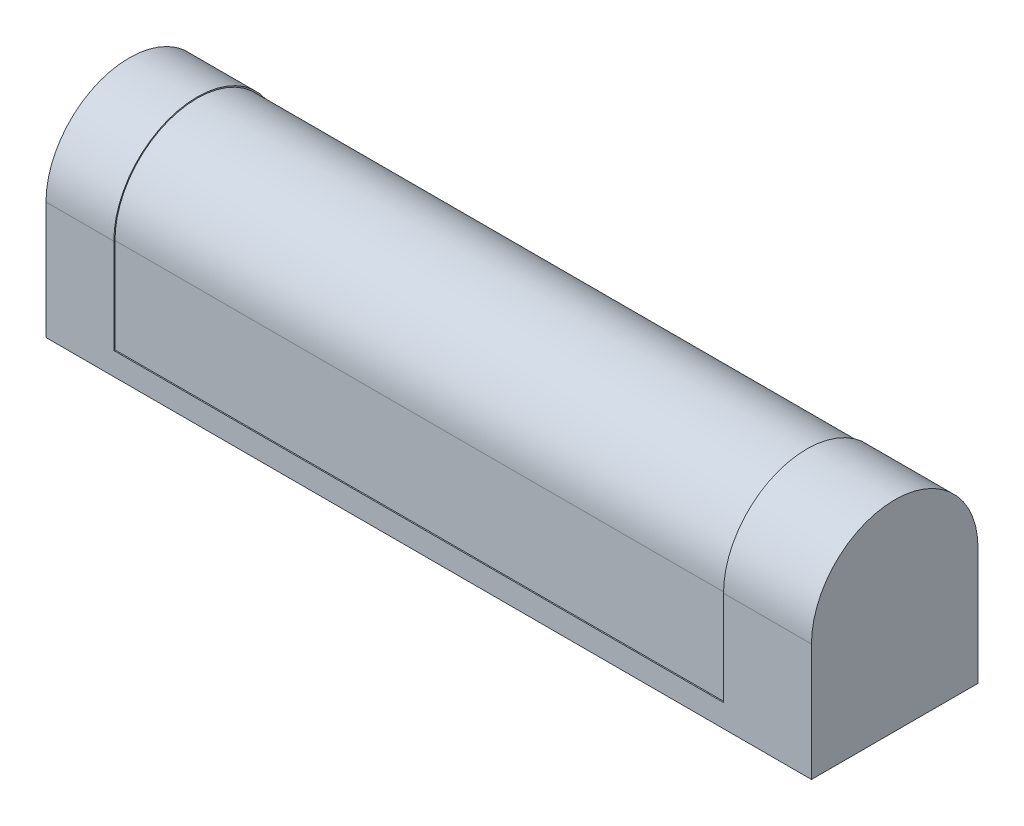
ISO-10303-21;
HEADER;
FILE_DESCRIPTION(('STEP AP214'),'2;1');
FILE_NAME('part.step','',(''),(''),'','','');
FILE_SCHEMA(('AUTOMOTIVE_DESIGN { 1 0 10303 214 1 1 1 1 }'));
ENDSEC;
DATA;
#1=APPLICATION_CONTEXT('core data for automotive mechanical design processes');
#2=APPLICATION_PROTOCOL_DEFINITION('international standard','automotive_design',2000,#1);
#3=PRODUCT_CONTEXT('',#1,'mechanical');
#4=PRODUCT('Part','Part','',(#3));
#5=PRODUCT_RELATED_PRODUCT_CATEGORY('part','',(#4));
#6=PRODUCT_DEFINITION_FORMATION('','',#4);
#7=PRODUCT_DEFINITION_CONTEXT('part definition',#1,'design');
#8=PRODUCT_DEFINITION('design','',#6,#7);
#9=PRODUCT_DEFINITION_SHAPE('','',#8);
#10=(LENGTH_UNIT() NAMED_UNIT(*) SI_UNIT(.MILLI.,.METRE.));
#11=(NAMED_UNIT(*) PLANE_ANGLE_UNIT() SI_UNIT($,.RADIAN.));
#12=(NAMED_UNIT(*) SI_UNIT($,.STERADIAN.) SOLID_ANGLE_UNIT());
#13=UNCERTAINTY_MEASURE_WITH_UNIT(LENGTH_MEASURE(1.E-05),#10,'distance_accuracy_value','');
#14=(GEOMETRIC_REPRESENTATION_CONTEXT(3) GLOBAL_UNCERTAINTY_ASSIGNED_CONTEXT((#13)) GLOBAL_UNIT_ASSIGNED_CONTEXT((#10,
#11,#12)) REPRESENTATION_CONTEXT('',''));
#15=CARTESIAN_POINT('',(0.,0.,0.));
#16=DIRECTION('',(0.,0.,1.));
#17=DIRECTION('',(1.,0.,0.));
#18=AXIS2_PLACEMENT_3D('',#15,#16,#17);
#19=CARTESIAN_POINT('',(252.25,-46.3414841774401,-37.5577918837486));
#20=DIRECTION('',(-1.,0.,0.));
#21=DIRECTION('',(0.,0.,1.00000000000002));
#22=AXIS2_PLACEMENT_3D('',#19,#20,#21);
#23=PLANE('',#22);
#24=DIRECTION('',(0.,1.,0.));
#25=VECTOR('',#24,1.);
#26=CARTESIAN_POINT('',(252.25,0.,30.5681588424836));
#27=LINE('',#26,#25);
#28=CARTESIAN_POINT('',(252.25,-35.2611658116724,30.5681588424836));
#29=VERTEX_POINT('',#28);
#30=CARTESIAN_POINT('',(252.25,0.,30.5681588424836));
#31=VERTEX_POINT('',#30);
#32=EDGE_CURVE('E135',#29,#31,#27,.T.);
#33=ORIENTED_EDGE('',*,*,#32,.F.);
#34=DIRECTION('',(0.,0.,-1.00000000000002));
#35=VECTOR('',#34,1.);
#36=CARTESIAN_POINT('',(252.25,-35.2611658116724,258.156804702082));
#37=LINE('',#36,#35);
#38=CARTESIAN_POINT('',(252.25,-35.2611658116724,31.0000000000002));
#39=VERTEX_POINT('',#38);
#40=EDGE_CURVE('E123',#39,#29,#37,.T.);
#41=ORIENTED_EDGE('',*,*,#40,.F.);
#42=DIRECTION('',(0.,1.,0.));
#43=VECTOR('',#42,1.);
#44=CARTESIAN_POINT('',(252.25,0.,31.0000000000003));
#45=LINE('',#44,#43);
#46=CARTESIAN_POINT('',(252.25,0.,31.0000000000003));
#47=VERTEX_POINT('',#46);
#48=EDGE_CURVE('E170',#39,#47,#45,.T.);
#49=ORIENTED_EDGE('',*,*,#48,.T.);
#50=CARTESIAN_POINT('',(252.25,0.,-2.4980018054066E-13));
#51=DIRECTION('',(-1.,0.,0.));
#52=DIRECTION('',(0.,0.,1.00000000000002));
#53=AXIS2_PLACEMENT_3D('',#50,#51,#52);
#54=CIRCLE('',#53,31.);
#55=CARTESIAN_POINT('',(252.25,0.,-31.0000000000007));
#56=VERTEX_POINT('',#55);
#57=EDGE_CURVE('E58',#47,#56,#54,.T.);
#58=ORIENTED_EDGE('',*,*,#57,.T.);
#59=DIRECTION('',(0.,-1.,0.));
#60=VECTOR('',#59,1.);
#61=CARTESIAN_POINT('',(252.25,0.,-31.0000000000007));
#62=LINE('',#61,#60);
#63=CARTESIAN_POINT('',(252.25,-38.3168771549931,-31.000000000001));
#64=VERTEX_POINT('',#63);
#65=EDGE_CURVE('E11',#56,#64,#62,.T.);
#66=ORIENTED_EDGE('',*,*,#65,.T.);
#67=DIRECTION('',(0.,0.,1.00000000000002));
#68=VECTOR('',#67,1.);
#69=CARTESIAN_POINT('',(252.25,-38.3168771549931,-31.000000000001));
#70=LINE('',#69,#68);
#71=CARTESIAN_POINT('',(252.25,-38.3168771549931,-30.5681588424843));
#72=VERTEX_POINT('',#71);
#73=EDGE_CURVE('E240',#64,#72,#70,.T.);
#74=ORIENTED_EDGE('',*,*,#73,.T.);
#75=DIRECTION('',(0.,-1.,0.));
#76=VECTOR('',#75,1.);
#77=CARTESIAN_POINT('',(252.25,0.,-30.5681588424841));
#78=LINE('',#77,#76);
#79=CARTESIAN_POINT('',(252.25,0.,-30.5681588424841));
#80=VERTEX_POINT('',#79);
#81=EDGE_CURVE('E145',#80,#72,#78,.T.);
#82=ORIENTED_EDGE('',*,*,#81,.F.);
#83=CARTESIAN_POINT('',(252.25,0.,-2.4980018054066E-13));
#84=DIRECTION('',(-1.,0.,0.));
#85=DIRECTION('',(0.,0.,1.00000000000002));
#86=AXIS2_PLACEMENT_3D('',#83,#84,#85);
#87=CIRCLE('',#86,30.5681588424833);
#88=EDGE_CURVE('E143',#31,#80,#87,.T.);
#89=ORIENTED_EDGE('',*,*,#88,.F.);
#90=EDGE_LOOP('',(#33,#41,#49,#58,#66,#74,#82,#89));
#91=FACE_BOUND('',#90,.T.);
#92=ADVANCED_FACE('F36',(#91),#23,.T.);
#93=CARTESIAN_POINT('',(25.2500000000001,-46.3414841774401,-37.5577918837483));
#94=DIRECTION('',(-1.,0.,0.));
#95=DIRECTION('',(0.,0.,1.00000000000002));
#96=AXIS2_PLACEMENT_3D('',#93,#94,#95);
#97=PLANE('',#96);
#98=DIRECTION('',(0.,0.,-1.00000000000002));
#99=VECTOR('',#98,1.);
#100=CARTESIAN_POINT('',(25.25,-35.2611658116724,258.156804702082));
#101=LINE('',#100,#99);
#102=CARTESIAN_POINT('',(25.25,-35.2611658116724,31.0000000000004));
#103=VERTEX_POINT('',#102);
#104=CARTESIAN_POINT('',(25.2500000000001,-35.2611658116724,30.5681588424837));
#105=VERTEX_POINT('',#104);
#106=EDGE_CURVE('E51',#103,#105,#101,.T.);
#107=ORIENTED_EDGE('',*,*,#106,.T.);
#108=DIRECTION('',(0.,1.,0.));
#109=VECTOR('',#108,1.);
#110=CARTESIAN_POINT('',(25.2500000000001,0.,30.5681588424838));
#111=LINE('',#110,#109);
#112=CARTESIAN_POINT('',(25.2500000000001,0.,30.5681588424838));
#113=VERTEX_POINT('',#112);
#114=EDGE_CURVE('E137',#105,#113,#111,.T.);
#115=ORIENTED_EDGE('',*,*,#114,.T.);
#116=CARTESIAN_POINT('',(25.25,0.,0.));
#117=DIRECTION('',(-1.,0.,0.));
#118=DIRECTION('',(0.,0.,1.00000000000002));
#119=AXIS2_PLACEMENT_3D('',#116,#117,#118);
#120=CIRCLE('',#119,30.5681588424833);
#121=CARTESIAN_POINT('',(25.250000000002,0.,-30.5681588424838));
#122=VERTEX_POINT('',#121);
#123=EDGE_CURVE('E154',#113,#122,#120,.T.);
#124=ORIENTED_EDGE('',*,*,#123,.T.);
#125=DIRECTION('',(0.,-1.,0.));
#126=VECTOR('',#125,1.);
#127=CARTESIAN_POINT('',(25.250000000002,0.,-30.5681588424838));
#128=LINE('',#127,#126);
#129=CARTESIAN_POINT('',(25.250000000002,-38.3168771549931,-30.5681588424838));
#130=VERTEX_POINT('',#129);
#131=EDGE_CURVE('E156',#122,#130,#128,.T.);
#132=ORIENTED_EDGE('',*,*,#131,.T.);
#133=DIRECTION('',(0.,0.,1.00000000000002));
#134=VECTOR('',#133,1.);
#135=CARTESIAN_POINT('',(25.250000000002,-38.3168771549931,-31.0000000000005));
#136=LINE('',#135,#134);
#137=CARTESIAN_POINT('',(25.250000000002,-38.3168771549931,-31.0000000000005));
#138=VERTEX_POINT('',#137);
#139=EDGE_CURVE('E216',#138,#130,#136,.T.);
#140=ORIENTED_EDGE('',*,*,#139,.F.);
#141=DIRECTION('',(0.,-1.,0.));
#142=VECTOR('',#141,1.);
#143=CARTESIAN_POINT('',(25.250000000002,0.,-31.0000000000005));
#144=LINE('',#143,#142);
#145=CARTESIAN_POINT('',(25.250000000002,0.,-31.0000000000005));
#146=VERTEX_POINT('',#145);
#147=EDGE_CURVE('E44',#146,#138,#144,.T.);
#148=ORIENTED_EDGE('',*,*,#147,.F.);
#149=CARTESIAN_POINT('',(25.25,0.,0.));
#150=DIRECTION('',(-1.,0.,0.));
#151=DIRECTION('',(0.,0.,1.00000000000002));
#152=AXIS2_PLACEMENT_3D('',#149,#150,#151);
#153=CIRCLE('',#152,31.);
#154=CARTESIAN_POINT('',(25.25,0.,31.0000000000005));
#155=VERTEX_POINT('',#154);
#156=EDGE_CURVE('E167',#155,#146,#153,.T.);
#157=ORIENTED_EDGE('',*,*,#156,.F.);
#158=DIRECTION('',(0.,1.,0.));
#159=VECTOR('',#158,1.);
#160=CARTESIAN_POINT('',(25.25,0.,31.0000000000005));
#161=LINE('',#160,#159);
#162=EDGE_CURVE('E163',#103,#155,#161,.T.);
#163=ORIENTED_EDGE('',*,*,#162,.F.);
#164=EDGE_LOOP('',(#107,#115,#124,#132,#140,#148,#157,#163));
#165=FACE_BOUND('',#164,.T.);
#166=ADVANCED_FACE('F213',(#165),#97,.F.);
#167=CARTESIAN_POINT('',(252.25,0.,30.5681588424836));
#168=DIRECTION('',(0.,0.,1.00000000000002));
#169=DIRECTION('',(1.,0.,0.));
#170=AXIS2_PLACEMENT_3D('',#167,#168,#169);
#171=PLANE('',#170);
#172=ORIENTED_EDGE('',*,*,#114,.F.);
#173=DIRECTION('',(-1.,0.,0.));
#174=VECTOR('',#173,1.);
#175=CARTESIAN_POINT('',(252.25,-35.2611658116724,30.5681588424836));
#176=LINE('',#175,#174);
#177=EDGE_CURVE('E126',#29,#105,#176,.T.);
#178=ORIENTED_EDGE('',*,*,#177,.F.);
#179=ORIENTED_EDGE('',*,*,#32,.T.);
#180=DIRECTION('',(-1.,0.,0.));
#181=VECTOR('',#180,1.);
#182=CARTESIAN_POINT('',(252.25,0.,30.5681588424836));
#183=LINE('',#182,#181);
#184=EDGE_CURVE('E161',#31,#113,#183,.T.);
#185=ORIENTED_EDGE('',*,*,#184,.T.);
#186=EDGE_LOOP('',(#172,#178,#179,#185));
#187=FACE_BOUND('',#186,.T.);
#188=ADVANCED_FACE('F133',(#187),#171,.T.);
#189=CARTESIAN_POINT('',(285.,0.,-2.4980018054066E-13));
#190=DIRECTION('',(-1.,0.,0.));
#191=DIRECTION('',(0.,0.,1.00000000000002));
#192=AXIS2_PLACEMENT_3D('',#189,#190,#191);
#193=CYLINDRICAL_SURFACE('',#192,31.);
#194=ORIENTED_EDGE('',*,*,#57,.F.);
#195=DIRECTION('',(-1.,0.,0.));
#196=VECTOR('',#195,1.);
#197=CARTESIAN_POINT('',(285.,0.,31.0000000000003));
#198=LINE('',#197,#196);
#199=CARTESIAN_POINT('',(285.,0.,31.0000000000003));
#200=VERTEX_POINT('',#199);
#201=EDGE_CURVE('E203',#200,#47,#198,.T.);
#202=ORIENTED_EDGE('',*,*,#201,.F.);
#203=CARTESIAN_POINT('',(285.,0.,-2.4980018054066E-13));
#204=DIRECTION('',(1.,0.,0.));
#205=DIRECTION('',(0.,0.,-1.00000000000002));
#206=AXIS2_PLACEMENT_3D('',#203,#204,#205);
#207=CIRCLE('',#206,31.);
#208=CARTESIAN_POINT('',(285.,0.,-31.0000000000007));
#209=VERTEX_POINT('',#208);
#210=EDGE_CURVE('E174',#209,#200,#207,.T.);
#211=ORIENTED_EDGE('',*,*,#210,.F.);
#212=DIRECTION('',(-1.,0.,0.));
#213=VECTOR('',#212,1.);
#214=CARTESIAN_POINT('',(285.,0.,-31.0000000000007));
#215=LINE('',#214,#213);
#216=EDGE_CURVE('E195',#209,#56,#215,.T.);
#217=ORIENTED_EDGE('',*,*,#216,.T.);
#218=EDGE_LOOP('',(#194,#202,#211,#217));
#219=FACE_BOUND('',#218,.T.);
#220=ADVANCED_FACE('F238',(#219),#193,.T.);
#221=CARTESIAN_POINT('',(285.,0.,-2.4980018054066E-13));
#222=DIRECTION('',(1.,0.,0.));
#223=DIRECTION('',(0.,0.,-1.00000000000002));
#224=AXIS2_PLACEMENT_3D('',#221,#222,#223);
#225=PLANE('',#224);
#226=ORIENTED_EDGE('',*,*,#210,.T.);
#227=DIRECTION('',(0.,-1.,0.));
#228=VECTOR('',#227,1.);
#229=CARTESIAN_POINT('',(285.,0.,31.0000000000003));
#230=LINE('',#229,#228);
#231=CARTESIAN_POINT('',(285.,-43.7000000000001,31.0000000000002));
#232=VERTEX_POINT('',#231);
#233=EDGE_CURVE('E177',#200,#232,#230,.T.);
#234=ORIENTED_EDGE('',*,*,#233,.T.);
#235=DIRECTION('',(0.,0.,-1.00000000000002));
#236=VECTOR('',#235,1.);
#237=CARTESIAN_POINT('',(285.,-43.7000000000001,31.0000000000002));
#238=LINE('',#237,#236);
#239=CARTESIAN_POINT('',(285.,-43.7000000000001,-31.0000000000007));
#240=VERTEX_POINT('',#239);
#241=EDGE_CURVE('E180',#232,#240,#238,.T.);
#242=ORIENTED_EDGE('',*,*,#241,.T.);
#243=DIRECTION('',(0.,1.,0.));
#244=VECTOR('',#243,1.);
#245=CARTESIAN_POINT('',(285.,0.,-31.0000000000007));
#246=LINE('',#245,#244);
#247=EDGE_CURVE('E182',#240,#209,#246,.T.);
#248=ORIENTED_EDGE('',*,*,#247,.T.);
#249=EDGE_LOOP('',(#226,#234,#242,#248));
#250=FACE_BOUND('',#249,.T.);
#251=ADVANCED_FACE('F235',(#250),#225,.T.);
#252=CARTESIAN_POINT('',(252.25,0.,-2.4980018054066E-13));
#253=DIRECTION('',(-1.,0.,0.));
#254=DIRECTION('',(0.,0.,1.00000000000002));
#255=AXIS2_PLACEMENT_3D('',#252,#253,#254);
#256=CYLINDRICAL_SURFACE('',#255,30.5681588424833);
#257=ORIENTED_EDGE('',*,*,#123,.F.);
#258=ORIENTED_EDGE('',*,*,#184,.F.);
#259=ORIENTED_EDGE('',*,*,#88,.T.);
#260=DIRECTION('',(-1.,0.,0.));
#261=VECTOR('',#260,1.);
#262=CARTESIAN_POINT('',(252.25,0.,-30.5681588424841));
#263=LINE('',#262,#261);
#264=EDGE_CURVE('E144',#80,#122,#263,.T.);
#265=ORIENTED_EDGE('',*,*,#264,.T.);
#266=EDGE_LOOP('',(#257,#258,#259,#265));
#267=FACE_BOUND('',#266,.T.);
#268=ADVANCED_FACE('F248',(#267),#256,.T.);
#269=CARTESIAN_POINT('',(252.25,0.,-30.5681588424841));
#270=DIRECTION('',(0.,0.,-1.00000000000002));
#271=DIRECTION('',(-1.,0.,0.));
#272=AXIS2_PLACEMENT_3D('',#269,#270,#271);
#273=PLANE('',#272);
#274=ORIENTED_EDGE('',*,*,#131,.F.);
#275=ORIENTED_EDGE('',*,*,#264,.F.);
#276=ORIENTED_EDGE('',*,*,#81,.T.);
#277=DIRECTION('',(-1.,0.,0.));
#278=VECTOR('',#277,1.);
#279=CARTESIAN_POINT('',(252.25,-38.3168771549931,-30.5681588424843));
#280=LINE('',#279,#278);
#281=EDGE_CURVE('E148',#72,#130,#280,.T.);
#282=ORIENTED_EDGE('',*,*,#281,.T.);
#283=EDGE_LOOP('',(#274,#275,#276,#282));
#284=FACE_BOUND('',#283,.T.);
#285=ADVANCED_FACE('F245',(#284),#273,.T.);
#286=CARTESIAN_POINT('',(0.,0.,0.));
#287=DIRECTION('',(1.,0.,0.));
#288=DIRECTION('',(0.,0.,-1.00000000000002));
#289=AXIS2_PLACEMENT_3D('',#286,#287,#288);
#290=PLANE('',#289);
#291=CARTESIAN_POINT('',(0.,0.,0.));
#292=DIRECTION('',(1.,0.,0.));
#293=DIRECTION('',(0.,0.,-1.00000000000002));
#294=AXIS2_PLACEMENT_3D('',#291,#292,#293);
#295=CIRCLE('',#294,31.);
#296=CARTESIAN_POINT('',(1.99840144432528E-12,0.,-31.0000000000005));
#297=VERTEX_POINT('',#296);
#298=CARTESIAN_POINT('',(0.,0.,31.0000000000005));
#299=VERTEX_POINT('',#298);
#300=EDGE_CURVE('E173',#297,#299,#295,.T.);
#301=ORIENTED_EDGE('',*,*,#300,.F.);
#302=DIRECTION('',(0.,1.,0.));
#303=VECTOR('',#302,1.);
#304=CARTESIAN_POINT('',(1.99840144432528E-12,0.,-31.0000000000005));
#305=LINE('',#304,#303);
#306=CARTESIAN_POINT('',(1.99840144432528E-12,-43.7000000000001,-31.0000000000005));
#307=VERTEX_POINT('',#306);
#308=EDGE_CURVE('E178',#307,#297,#305,.T.);
#309=ORIENTED_EDGE('',*,*,#308,.F.);
#310=DIRECTION('',(0.,0.,-1.00000000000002));
#311=VECTOR('',#310,1.);
#312=CARTESIAN_POINT('',(0.,-43.7000000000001,31.0000000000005));
#313=LINE('',#312,#311);
#314=CARTESIAN_POINT('',(0.,-43.7000000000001,31.0000000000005));
#315=VERTEX_POINT('',#314);
#316=EDGE_CURVE('E190',#315,#307,#313,.T.);
#317=ORIENTED_EDGE('',*,*,#316,.F.);
#318=DIRECTION('',(0.,-1.,0.));
#319=VECTOR('',#318,1.);
#320=CARTESIAN_POINT('',(0.,0.,31.0000000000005));
#321=LINE('',#320,#319);
#322=EDGE_CURVE('E187',#299,#315,#321,.T.);
#323=ORIENTED_EDGE('',*,*,#322,.F.);
#324=EDGE_LOOP('',(#301,#309,#317,#323));
#325=FACE_BOUND('',#324,.T.);
#326=ADVANCED_FACE('F225',(#325),#290,.F.);
#327=CARTESIAN_POINT('',(285.,0.,-31.0000000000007));
#328=DIRECTION('',(0.,0.,1.00000000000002));
#329=DIRECTION('',(1.,0.,0.));
#330=AXIS2_PLACEMENT_3D('',#327,#328,#329);
#331=PLANE('',#330);
#332=EDGE_CURVE('E184',#146,#297,#215,.T.);
#333=ORIENTED_EDGE('',*,*,#332,.F.);
#334=ORIENTED_EDGE('',*,*,#147,.T.);
#335=DIRECTION('',(-1.,0.,0.));
#336=VECTOR('',#335,1.);
#337=CARTESIAN_POINT('',(252.25,-38.3168771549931,-31.000000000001));
#338=LINE('',#337,#336);
#339=EDGE_CURVE('E157',#64,#138,#338,.T.);
#340=ORIENTED_EDGE('',*,*,#339,.F.);
#341=ORIENTED_EDGE('',*,*,#65,.F.);
#342=ORIENTED_EDGE('',*,*,#216,.F.);
#343=ORIENTED_EDGE('',*,*,#247,.F.);
#344=DIRECTION('',(-1.,0.,0.));
#345=VECTOR('',#344,1.);
#346=CARTESIAN_POINT('',(285.,-43.7000000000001,-31.0000000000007));
#347=LINE('',#346,#345);
#348=EDGE_CURVE('E198',#240,#307,#347,.T.);
#349=ORIENTED_EDGE('',*,*,#348,.T.);
#350=ORIENTED_EDGE('',*,*,#308,.T.);
#351=EDGE_LOOP('',(#333,#334,#340,#341,#342,#343,#349,#350));
#352=FACE_BOUND('',#351,.T.);
#353=ADVANCED_FACE('F209',(#352),#331,.F.);
#354=CARTESIAN_POINT('',(285.,-43.7000000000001,31.0000000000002));
#355=DIRECTION('',(0.,1.,0.));
#356=DIRECTION('',(0.,0.,1.00000000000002));
#357=AXIS2_PLACEMENT_3D('',#354,#355,#356);
#358=PLANE('',#357);
#359=CARTESIAN_POINT('',(279.025,-43.7000000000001,-25.4000000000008));
#360=DIRECTION('',(0.,-1.,0.));
#361=DIRECTION('',(0.,0.,-1.00000000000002));
#362=AXIS2_PLACEMENT_3D('',#359,#360,#361);
#363=CIRCLE('',#362,3.99999999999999);
#364=CARTESIAN_POINT('',(279.025,-43.7000000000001,-29.4000000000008));
#365=VERTEX_POINT('',#364);
#366=EDGE_CURVE('E272',#365,#365,#363,.T.);
#367=ORIENTED_EDGE('',*,*,#366,.F.);
#368=EDGE_LOOP('',(#367));
#369=FACE_BOUND('',#368,.T.);
#370=CARTESIAN_POINT('',(279.025,-43.7000000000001,25.4000000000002));
#371=DIRECTION('',(0.,-1.,0.));
#372=DIRECTION('',(0.,0.,-1.00000000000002));
#373=AXIS2_PLACEMENT_3D('',#370,#371,#372);
#374=CIRCLE('',#373,3.99999999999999);
#375=CARTESIAN_POINT('',(279.025,-43.7000000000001,21.4000000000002));
#376=VERTEX_POINT('',#375);
#377=EDGE_CURVE('E266',#376,#376,#374,.T.);
#378=ORIENTED_EDGE('',*,*,#377,.F.);
#379=EDGE_LOOP('',(#378));
#380=FACE_BOUND('',#379,.T.);
#381=CARTESIAN_POINT('',(5.97500000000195,-43.7000000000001,-25.4000000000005));
#382=DIRECTION('',(0.,-1.,0.));
#383=DIRECTION('',(0.,0.,-1.00000000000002));
#384=AXIS2_PLACEMENT_3D('',#381,#382,#383);
#385=CIRCLE('',#384,4.);
#386=CARTESIAN_POINT('',(5.97500000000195,-43.7000000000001,-29.4000000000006));
#387=VERTEX_POINT('',#386);
#388=EDGE_CURVE('E260',#387,#387,#385,.T.);
#389=ORIENTED_EDGE('',*,*,#388,.F.);
#390=EDGE_LOOP('',(#389));
#391=FACE_BOUND('',#390,.T.);
#392=CARTESIAN_POINT('',(5.97500000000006,-43.7000000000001,25.4000000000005));
#393=DIRECTION('',(0.,-1.,0.));
#394=DIRECTION('',(0.,0.,-1.00000000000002));
#395=AXIS2_PLACEMENT_3D('',#392,#393,#394);
#396=CIRCLE('',#395,4.);
#397=CARTESIAN_POINT('',(5.97500000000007,-43.7000000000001,21.4000000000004));
#398=VERTEX_POINT('',#397);
#399=EDGE_CURVE('E254',#398,#398,#396,.T.);
#400=ORIENTED_EDGE('',*,*,#399,.F.);
#401=EDGE_LOOP('',(#400));
#402=FACE_BOUND('',#401,.T.);
#403=DIRECTION('',(-1.,0.,0.));
#404=VECTOR('',#403,1.);
#405=CARTESIAN_POINT('',(285.,-43.7000000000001,31.0000000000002));
#406=LINE('',#405,#404);
#407=EDGE_CURVE('E200',#232,#315,#406,.T.);
#408=ORIENTED_EDGE('',*,*,#407,.T.);
#409=ORIENTED_EDGE('',*,*,#316,.T.);
#410=ORIENTED_EDGE('',*,*,#348,.F.);
#411=ORIENTED_EDGE('',*,*,#241,.F.);
#412=EDGE_LOOP('',(#408,#409,#410,#411));
#413=FACE_BOUND('',#412,.T.);
#414=ADVANCED_FACE('F229',(#369,#380,#391,#402,#413),#358,.F.);
#415=CARTESIAN_POINT('',(285.,0.,31.0000000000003));
#416=DIRECTION('',(0.,0.,-1.00000000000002));
#417=DIRECTION('',(0.,1.,0.));
#418=AXIS2_PLACEMENT_3D('',#415,#416,#417);
#419=PLANE('',#418);
#420=ORIENTED_EDGE('',*,*,#322,.T.);
#421=ORIENTED_EDGE('',*,*,#407,.F.);
#422=ORIENTED_EDGE('',*,*,#233,.F.);
#423=ORIENTED_EDGE('',*,*,#201,.T.);
#424=ORIENTED_EDGE('',*,*,#48,.F.);
#425=DIRECTION('',(1.,0.,0.));
#426=VECTOR('',#425,1.);
#427=CARTESIAN_POINT('',(252.25,-35.2611658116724,31.0000000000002));
#428=LINE('',#427,#426);
#429=EDGE_CURVE('E127',#103,#39,#428,.T.);
#430=ORIENTED_EDGE('',*,*,#429,.F.);
#431=ORIENTED_EDGE('',*,*,#162,.T.);
#432=EDGE_CURVE('E202',#155,#299,#198,.T.);
#433=ORIENTED_EDGE('',*,*,#432,.T.);
#434=EDGE_LOOP('',(#420,#421,#422,#423,#424,#430,#431,#433));
#435=FACE_BOUND('',#434,.T.);
#436=ADVANCED_FACE('F221',(#435),#419,.F.);
#437=ORIENTED_EDGE('',*,*,#432,.F.);
#438=ORIENTED_EDGE('',*,*,#156,.T.);
#439=ORIENTED_EDGE('',*,*,#332,.T.);
#440=ORIENTED_EDGE('',*,*,#300,.T.);
#441=EDGE_LOOP('',(#437,#438,#439,#440));
#442=FACE_BOUND('',#441,.T.);
#443=ADVANCED_FACE('F38',(#442),#193,.T.);
#444=CARTESIAN_POINT('',(252.25,-38.3168771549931,-31.000000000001));
#445=DIRECTION('',(0.,-1.,0.));
#446=DIRECTION('',(0.,0.,-1.00000000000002));
#447=AXIS2_PLACEMENT_3D('',#444,#445,#446);
#448=PLANE('',#447);
#449=ORIENTED_EDGE('',*,*,#281,.F.);
#450=ORIENTED_EDGE('',*,*,#73,.F.);
#451=ORIENTED_EDGE('',*,*,#339,.T.);
#452=ORIENTED_EDGE('',*,*,#139,.T.);
#453=EDGE_LOOP('',(#449,#450,#451,#452));
#454=FACE_BOUND('',#453,.T.);
#455=ADVANCED_FACE('F308',(#454),#448,.F.);
#456=CARTESIAN_POINT('',(252.25,-35.2611658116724,258.156804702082));
#457=DIRECTION('',(0.,-1.,0.));
#458=DIRECTION('',(0.,0.,-1.00000000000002));
#459=AXIS2_PLACEMENT_3D('',#456,#457,#458);
#460=PLANE('',#459);
#461=ORIENTED_EDGE('',*,*,#106,.F.);
#462=ORIENTED_EDGE('',*,*,#429,.T.);
#463=ORIENTED_EDGE('',*,*,#40,.T.);
#464=ORIENTED_EDGE('',*,*,#177,.T.);
#465=EDGE_LOOP('',(#461,#462,#463,#464));
#466=FACE_BOUND('',#465,.T.);
#467=ADVANCED_FACE('F125',(#466),#460,.F.);
#468=CARTESIAN_POINT('',(5.97500000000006,-33.7000000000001,25.4000000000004));
#469=DIRECTION('',(0.,-1.,0.));
#470=DIRECTION('',(0.,0.,-1.00000000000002));
#471=AXIS2_PLACEMENT_3D('',#468,#469,#470);
#472=CYLINDRICAL_SURFACE('',#471,4.);
#473=CARTESIAN_POINT('',(5.97500000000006,-33.7000000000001,25.4000000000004));
#474=DIRECTION('',(0.,-1.,0.));
#475=DIRECTION('',(0.,0.,-1.00000000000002));
#476=AXIS2_PLACEMENT_3D('',#473,#474,#475);
#477=CIRCLE('',#476,4.);
#478=CARTESIAN_POINT('',(5.97500000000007,-33.7000000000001,21.4000000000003));
#479=VERTEX_POINT('',#478);
#480=EDGE_CURVE('E138',#479,#479,#477,.T.);
#481=ORIENTED_EDGE('',*,*,#480,.F.);
#482=EDGE_LOOP('',(#481));
#483=FACE_BOUND('',#482,.T.);
#484=ORIENTED_EDGE('',*,*,#399,.T.);
#485=EDGE_LOOP('',(#484));
#486=FACE_BOUND('',#485,.T.);
#487=ADVANCED_FACE('F296',(#483,#486),#472,.F.);
#488=CARTESIAN_POINT('',(5.97500000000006,-33.7000000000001,25.4000000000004));
#489=DIRECTION('',(0.,-1.,0.));
#490=DIRECTION('',(0.,0.,-1.00000000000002));
#491=AXIS2_PLACEMENT_3D('',#488,#489,#490);
#492=PLANE('',#491);
#493=ORIENTED_EDGE('',*,*,#480,.T.);
#494=EDGE_LOOP('',(#493));
#495=FACE_BOUND('',#494,.T.);
#496=ADVANCED_FACE('F298',(#495),#492,.T.);
#497=CARTESIAN_POINT('',(5.97500000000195,-33.7000000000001,-25.4000000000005));
#498=DIRECTION('',(0.,-1.,0.));
#499=DIRECTION('',(0.,0.,-1.00000000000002));
#500=AXIS2_PLACEMENT_3D('',#497,#498,#499);
#501=CYLINDRICAL_SURFACE('',#500,4.);
#502=CARTESIAN_POINT('',(5.97500000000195,-33.7000000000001,-25.4000000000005));
#503=DIRECTION('',(0.,-1.,0.));
#504=DIRECTION('',(0.,0.,-1.00000000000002));
#505=AXIS2_PLACEMENT_3D('',#502,#503,#504);
#506=CIRCLE('',#505,4.);
#507=CARTESIAN_POINT('',(5.97500000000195,-33.7000000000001,-29.4000000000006));
#508=VERTEX_POINT('',#507);
#509=EDGE_CURVE('E257',#508,#508,#506,.T.);
#510=ORIENTED_EDGE('',*,*,#509,.F.);
#511=EDGE_LOOP('',(#510));
#512=FACE_BOUND('',#511,.T.);
#513=ORIENTED_EDGE('',*,*,#388,.T.);
#514=EDGE_LOOP('',(#513));
#515=FACE_BOUND('',#514,.T.);
#516=ADVANCED_FACE('F305',(#512,#515),#501,.F.);
#517=CARTESIAN_POINT('',(5.97500000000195,-33.7000000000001,-25.4000000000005));
#518=DIRECTION('',(0.,-1.,0.));
#519=DIRECTION('',(0.,0.,-1.00000000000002));
#520=AXIS2_PLACEMENT_3D('',#517,#518,#519);
#521=PLANE('',#520);
#522=ORIENTED_EDGE('',*,*,#509,.T.);
#523=EDGE_LOOP('',(#522));
#524=FACE_BOUND('',#523,.T.);
#525=ADVANCED_FACE('F417',(#524),#521,.T.);
#526=CARTESIAN_POINT('',(279.025,-33.7000000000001,25.4000000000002));
#527=DIRECTION('',(0.,-1.,0.));
#528=DIRECTION('',(0.,0.,-1.00000000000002));
#529=AXIS2_PLACEMENT_3D('',#526,#527,#528);
#530=CYLINDRICAL_SURFACE('',#529,3.99999999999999);
#531=CARTESIAN_POINT('',(279.025,-33.7000000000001,25.4000000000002));
#532=DIRECTION('',(0.,-1.,0.));
#533=DIRECTION('',(0.,0.,-1.00000000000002));
#534=AXIS2_PLACEMENT_3D('',#531,#532,#533);
#535=CIRCLE('',#534,3.99999999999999);
#536=CARTESIAN_POINT('',(279.025,-33.7000000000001,21.4000000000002));
#537=VERTEX_POINT('',#536);
#538=EDGE_CURVE('E263',#537,#537,#535,.T.);
#539=ORIENTED_EDGE('',*,*,#538,.F.);
#540=EDGE_LOOP('',(#539));
#541=FACE_BOUND('',#540,.T.);
#542=ORIENTED_EDGE('',*,*,#377,.T.);
#543=EDGE_LOOP('',(#542));
#544=FACE_BOUND('',#543,.T.);
#545=ADVANCED_FACE('F426',(#541,#544),#530,.F.);
#546=CARTESIAN_POINT('',(279.025,-33.7000000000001,25.4000000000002));
#547=DIRECTION('',(0.,-1.,0.));
#548=DIRECTION('',(0.,0.,-1.00000000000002));
#549=AXIS2_PLACEMENT_3D('',#546,#547,#548);
#550=PLANE('',#549);
#551=ORIENTED_EDGE('',*,*,#538,.T.);
#552=EDGE_LOOP('',(#551));
#553=FACE_BOUND('',#552,.T.);
#554=ADVANCED_FACE('F283',(#553),#550,.T.);
#555=CARTESIAN_POINT('',(279.025,-33.7000000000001,-25.4000000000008));
#556=DIRECTION('',(0.,-1.,0.));
#557=DIRECTION('',(0.,0.,-1.00000000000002));
#558=AXIS2_PLACEMENT_3D('',#555,#556,#557);
#559=CYLINDRICAL_SURFACE('',#558,3.99999999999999);
#560=CARTESIAN_POINT('',(279.025,-33.7000000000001,-25.4000000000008));
#561=DIRECTION('',(0.,-1.,0.));
#562=DIRECTION('',(0.,0.,-1.00000000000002));
#563=AXIS2_PLACEMENT_3D('',#560,#561,#562);
#564=CIRCLE('',#563,3.99999999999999);
#565=CARTESIAN_POINT('',(279.025,-33.7000000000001,-29.4000000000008));
#566=VERTEX_POINT('',#565);
#567=EDGE_CURVE('E269',#566,#566,#564,.T.);
#568=ORIENTED_EDGE('',*,*,#567,.F.);
#569=EDGE_LOOP('',(#568));
#570=FACE_BOUND('',#569,.T.);
#571=ORIENTED_EDGE('',*,*,#366,.T.);
#572=EDGE_LOOP('',(#571));
#573=FACE_BOUND('',#572,.T.);
#574=ADVANCED_FACE('F280',(#570,#573),#559,.F.);
#575=CARTESIAN_POINT('',(279.025,-33.7000000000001,-25.4000000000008));
#576=DIRECTION('',(0.,-1.,0.));
#577=DIRECTION('',(0.,0.,-1.00000000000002));
#578=AXIS2_PLACEMENT_3D('',#575,#576,#577);
#579=PLANE('',#578);
#580=ORIENTED_EDGE('',*,*,#567,.T.);
#581=EDGE_LOOP('',(#580));
#582=FACE_BOUND('',#581,.T.);
#583=ADVANCED_FACE('F278',(#582),#579,.T.);
#584=CLOSED_SHELL('',(#92,#166,#188,#220,#251,#268,#285,#326,#353,#414,#436,#443,#455,#467,#487,
#496,#516,#525,#545,#554,#574,#583));
#585=MANIFOLD_SOLID_BREP('B2',#584);
#586=ADVANCED_BREP_SHAPE_REPRESENTATION('',(#18,#585),#14);
#587=SHAPE_DEFINITION_REPRESENTATION(#9,#586);
ENDSEC;
END-ISO-10303-21;
